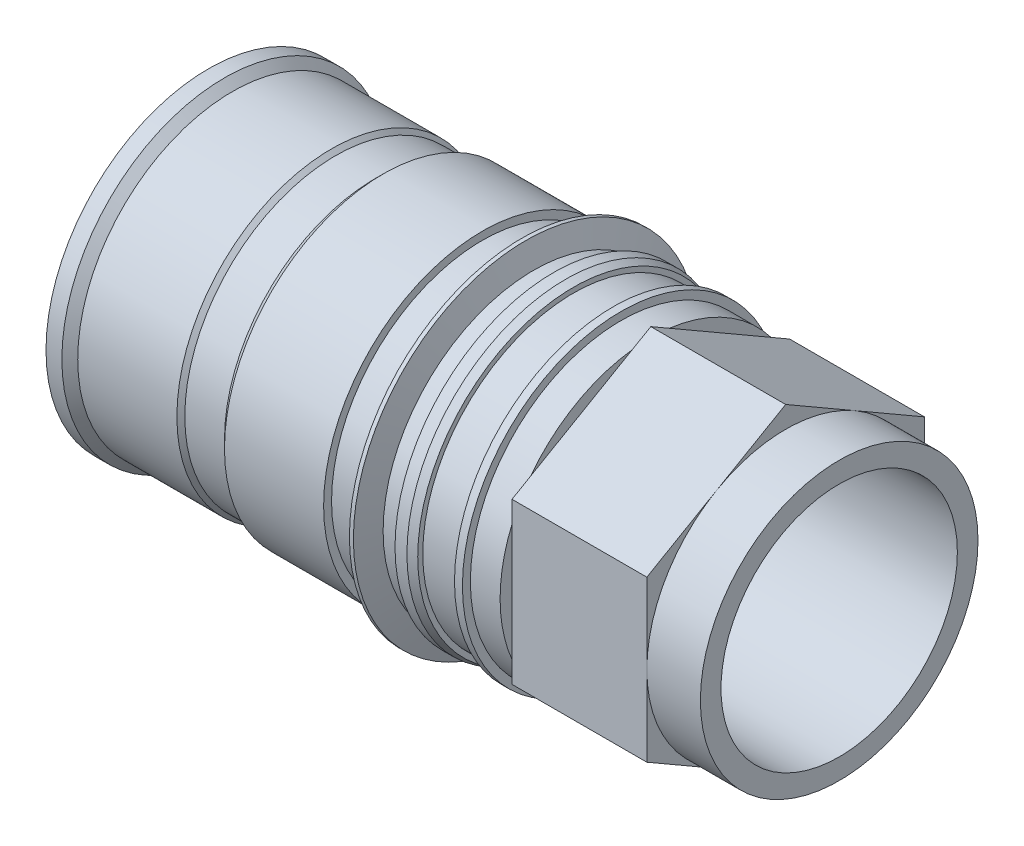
ISO-10303-21;
HEADER;
FILE_DESCRIPTION(('STEP AP214'),'2;1');
FILE_NAME('part.step','',(''),(''),'','','');
FILE_SCHEMA(('AUTOMOTIVE_DESIGN { 1 0 10303 214 1 1 1 1 }'));
ENDSEC;
DATA;
#1=APPLICATION_CONTEXT('core data for automotive mechanical design processes');
#2=APPLICATION_PROTOCOL_DEFINITION('international standard','automotive_design',2000,#1);
#3=PRODUCT_CONTEXT('',#1,'mechanical');
#4=PRODUCT('Part','Part','',(#3));
#5=PRODUCT_RELATED_PRODUCT_CATEGORY('part','',(#4));
#6=PRODUCT_DEFINITION_FORMATION('','',#4);
#7=PRODUCT_DEFINITION_CONTEXT('part definition',#1,'design');
#8=PRODUCT_DEFINITION('design','',#6,#7);
#9=PRODUCT_DEFINITION_SHAPE('','',#8);
#10=(LENGTH_UNIT() NAMED_UNIT(*) SI_UNIT(.MILLI.,.METRE.));
#11=(NAMED_UNIT(*) PLANE_ANGLE_UNIT() SI_UNIT($,.RADIAN.));
#12=(NAMED_UNIT(*) SI_UNIT($,.STERADIAN.) SOLID_ANGLE_UNIT());
#13=UNCERTAINTY_MEASURE_WITH_UNIT(LENGTH_MEASURE(1.E-05),#10,'distance_accuracy_value','');
#14=(GEOMETRIC_REPRESENTATION_CONTEXT(3) GLOBAL_UNCERTAINTY_ASSIGNED_CONTEXT((#13)) GLOBAL_UNIT_ASSIGNED_CONTEXT((#10,
#11,#12)) REPRESENTATION_CONTEXT('',''));
#15=CARTESIAN_POINT('',(0.,0.,0.));
#16=DIRECTION('',(0.,0.,1.));
#17=DIRECTION('',(1.,0.,0.));
#18=AXIS2_PLACEMENT_3D('',#15,#16,#17);
#19=CARTESIAN_POINT('',(145.5,0.,0.));
#20=DIRECTION('',(1.,0.,0.));
#21=DIRECTION('',(0.,0.,-1.));
#22=AXIS2_PLACEMENT_3D('',#19,#20,#21);
#23=PLANE('',#22);
#24=CARTESIAN_POINT('',(145.5,0.,0.));
#25=DIRECTION('',(1.,0.,0.));
#26=DIRECTION('',(0.,0.,-1.));
#27=AXIS2_PLACEMENT_3D('',#24,#25,#26);
#28=CIRCLE('',#27,35.);
#29=CARTESIAN_POINT('',(145.5,0.,-35.));
#30=VERTEX_POINT('',#29);
#31=CARTESIAN_POINT('',(145.5,30.3108891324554,-17.5));
#32=VERTEX_POINT('',#31);
#33=EDGE_CURVE('E44',#30,#32,#28,.T.);
#34=ORIENTED_EDGE('',*,*,#33,.F.);
#35=DIRECTION('',(0.,1.,0.));
#36=VECTOR('',#35,1.);
#37=CARTESIAN_POINT('',(145.5,-20.2072594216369,-35.));
#38=LINE('',#37,#36);
#39=CARTESIAN_POINT('',(145.5,20.2072594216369,-35.));
#40=VERTEX_POINT('',#39);
#41=EDGE_CURVE('E150',#30,#40,#38,.T.);
#42=ORIENTED_EDGE('',*,*,#41,.T.);
#43=DIRECTION('',(0.,0.5,0.866025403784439));
#44=VECTOR('',#43,1.);
#45=CARTESIAN_POINT('',(145.5,20.2072594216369,-35.));
#46=LINE('',#45,#44);
#47=EDGE_CURVE('E162',#40,#32,#46,.T.);
#48=ORIENTED_EDGE('',*,*,#47,.T.);
#49=EDGE_LOOP('',(#34,#42,#48));
#50=FACE_BOUND('',#49,.T.);
#51=ADVANCED_FACE('F33',(#50),#23,.T.);
#52=CARTESIAN_POINT('',(145.5,30.3108891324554,17.5));
#53=VERTEX_POINT('',#52);
#54=EDGE_CURVE('E11',#32,#53,#28,.T.);
#55=ORIENTED_EDGE('',*,*,#54,.F.);
#56=CARTESIAN_POINT('',(145.5,40.4145188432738,0.));
#57=VERTEX_POINT('',#56);
#58=EDGE_CURVE('E180',#32,#57,#46,.T.);
#59=ORIENTED_EDGE('',*,*,#58,.T.);
#60=DIRECTION('',(0.,-0.5,0.866025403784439));
#61=VECTOR('',#60,1.);
#62=CARTESIAN_POINT('',(145.5,40.4145188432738,0.));
#63=LINE('',#62,#61);
#64=EDGE_CURVE('E181',#57,#53,#63,.T.);
#65=ORIENTED_EDGE('',*,*,#64,.T.);
#66=EDGE_LOOP('',(#55,#59,#65));
#67=FACE_BOUND('',#66,.T.);
#68=ADVANCED_FACE('F371',(#67),#23,.T.);
#69=CARTESIAN_POINT('',(145.5,0.,35.));
#70=VERTEX_POINT('',#69);
#71=EDGE_CURVE('E42',#53,#70,#28,.T.);
#72=ORIENTED_EDGE('',*,*,#71,.F.);
#73=CARTESIAN_POINT('',(145.5,20.2072594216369,35.));
#74=VERTEX_POINT('',#73);
#75=EDGE_CURVE('E179',#53,#74,#63,.T.);
#76=ORIENTED_EDGE('',*,*,#75,.T.);
#77=DIRECTION('',(0.,-1.,0.));
#78=VECTOR('',#77,1.);
#79=CARTESIAN_POINT('',(145.5,20.2072594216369,35.));
#80=LINE('',#79,#78);
#81=EDGE_CURVE('E185',#74,#70,#80,.T.);
#82=ORIENTED_EDGE('',*,*,#81,.T.);
#83=EDGE_LOOP('',(#72,#76,#82));
#84=FACE_BOUND('',#83,.T.);
#85=ADVANCED_FACE('F376',(#84),#23,.T.);
#86=CARTESIAN_POINT('',(145.5,-30.3108891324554,17.5));
#87=VERTEX_POINT('',#86);
#88=EDGE_CURVE('E169',#70,#87,#28,.T.);
#89=ORIENTED_EDGE('',*,*,#88,.F.);
#90=CARTESIAN_POINT('',(145.5,-20.2072594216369,35.));
#91=VERTEX_POINT('',#90);
#92=EDGE_CURVE('E184',#70,#91,#80,.T.);
#93=ORIENTED_EDGE('',*,*,#92,.T.);
#94=DIRECTION('',(0.,-0.5,-0.866025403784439));
#95=VECTOR('',#94,1.);
#96=CARTESIAN_POINT('',(145.5,-20.2072594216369,35.));
#97=LINE('',#96,#95);
#98=EDGE_CURVE('E189',#91,#87,#97,.T.);
#99=ORIENTED_EDGE('',*,*,#98,.T.);
#100=EDGE_LOOP('',(#89,#93,#99));
#101=FACE_BOUND('',#100,.T.);
#102=ADVANCED_FACE('F390',(#101),#23,.T.);
#103=CARTESIAN_POINT('',(145.5,-30.3108891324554,-17.5));
#104=VERTEX_POINT('',#103);
#105=EDGE_CURVE('E59',#87,#104,#28,.T.);
#106=ORIENTED_EDGE('',*,*,#105,.F.);
#107=CARTESIAN_POINT('',(145.5,-40.4145188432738,0.));
#108=VERTEX_POINT('',#107);
#109=EDGE_CURVE('E188',#87,#108,#97,.T.);
#110=ORIENTED_EDGE('',*,*,#109,.T.);
#111=DIRECTION('',(0.,0.5,-0.866025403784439));
#112=VECTOR('',#111,1.);
#113=CARTESIAN_POINT('',(145.5,-40.4145188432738,0.));
#114=LINE('',#113,#112);
#115=EDGE_CURVE('E160',#108,#104,#114,.T.);
#116=ORIENTED_EDGE('',*,*,#115,.T.);
#117=EDGE_LOOP('',(#106,#110,#116));
#118=FACE_BOUND('',#117,.T.);
#119=ADVANCED_FACE('F381',(#118),#23,.T.);
#120=CARTESIAN_POINT('',(111.5,38.,0.));
#121=DIRECTION('',(-1.,0.,0.));
#122=DIRECTION('',(0.,0.,1.));
#123=AXIS2_PLACEMENT_3D('',#120,#121,#122);
#124=PLANE('',#123);
#125=DIRECTION('',(0.,0.5,0.866025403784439));
#126=VECTOR('',#125,1.);
#127=CARTESIAN_POINT('',(111.5,20.2072594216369,-35.));
#128=LINE('',#127,#126);
#129=CARTESIAN_POINT('',(111.5,22.911564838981,-30.3160056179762));
#130=VERTEX_POINT('',#129);
#131=CARTESIAN_POINT('',(111.5,37.7102134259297,-4.68399438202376));
#132=VERTEX_POINT('',#131);
#133=EDGE_CURVE('E168',#130,#132,#128,.T.);
#134=ORIENTED_EDGE('',*,*,#133,.F.);
#135=CARTESIAN_POINT('',(111.5,0.,0.));
#136=DIRECTION('',(-1.,0.,0.));
#137=DIRECTION('',(0.,0.,1.));
#138=AXIS2_PLACEMENT_3D('',#135,#136,#137);
#139=CIRCLE('',#138,38.);
#140=EDGE_CURVE('E328',#132,#130,#139,.T.);
#141=ORIENTED_EDGE('',*,*,#140,.F.);
#142=EDGE_LOOP('',(#134,#141));
#143=FACE_BOUND('',#142,.T.);
#144=ADVANCED_FACE('F365',(#143),#124,.F.);
#145=DIRECTION('',(0.,1.,0.));
#146=VECTOR('',#145,1.);
#147=CARTESIAN_POINT('',(111.5,-20.2072594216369,-35.));
#148=LINE('',#147,#146);
#149=CARTESIAN_POINT('',(111.5,-14.7986485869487,-35.));
#150=VERTEX_POINT('',#149);
#151=CARTESIAN_POINT('',(111.5,14.7986485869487,-35.));
#152=VERTEX_POINT('',#151);
#153=EDGE_CURVE('E171',#150,#152,#148,.T.);
#154=ORIENTED_EDGE('',*,*,#153,.F.);
#155=EDGE_CURVE('E334',#152,#150,#139,.T.);
#156=ORIENTED_EDGE('',*,*,#155,.F.);
#157=EDGE_LOOP('',(#154,#156));
#158=FACE_BOUND('',#157,.T.);
#159=ADVANCED_FACE('F395',(#158),#124,.F.);
#160=DIRECTION('',(0.,0.5,-0.866025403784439));
#161=VECTOR('',#160,1.);
#162=CARTESIAN_POINT('',(111.5,-40.4145188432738,0.));
#163=LINE('',#162,#161);
#164=CARTESIAN_POINT('',(111.5,-37.7102134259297,-4.68399438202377));
#165=VERTEX_POINT('',#164);
#166=CARTESIAN_POINT('',(111.5,-22.911564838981,-30.3160056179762));
#167=VERTEX_POINT('',#166);
#168=EDGE_CURVE('E214',#165,#167,#163,.T.);
#169=ORIENTED_EDGE('',*,*,#168,.F.);
#170=EDGE_CURVE('E340',#167,#165,#139,.T.);
#171=ORIENTED_EDGE('',*,*,#170,.F.);
#172=EDGE_LOOP('',(#169,#171));
#173=FACE_BOUND('',#172,.T.);
#174=ADVANCED_FACE('F366',(#173),#124,.F.);
#175=DIRECTION('',(0.,-0.5,-0.866025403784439));
#176=VECTOR('',#175,1.);
#177=CARTESIAN_POINT('',(111.5,-20.2072594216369,35.));
#178=LINE('',#177,#176);
#179=CARTESIAN_POINT('',(111.5,-22.911564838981,30.3160056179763));
#180=VERTEX_POINT('',#179);
#181=CARTESIAN_POINT('',(111.5,-37.7102134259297,4.68399438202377));
#182=VERTEX_POINT('',#181);
#183=EDGE_CURVE('E209',#180,#182,#178,.T.);
#184=ORIENTED_EDGE('',*,*,#183,.F.);
#185=EDGE_CURVE('E346',#182,#180,#139,.T.);
#186=ORIENTED_EDGE('',*,*,#185,.F.);
#187=EDGE_LOOP('',(#184,#186));
#188=FACE_BOUND('',#187,.T.);
#189=ADVANCED_FACE('F359',(#188),#124,.F.);
#190=DIRECTION('',(0.,-1.,0.));
#191=VECTOR('',#190,1.);
#192=CARTESIAN_POINT('',(111.5,20.2072594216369,35.));
#193=LINE('',#192,#191);
#194=CARTESIAN_POINT('',(111.5,14.7986485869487,35.));
#195=VERTEX_POINT('',#194);
#196=CARTESIAN_POINT('',(111.5,-14.7986485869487,35.));
#197=VERTEX_POINT('',#196);
#198=EDGE_CURVE('E204',#195,#197,#193,.T.);
#199=ORIENTED_EDGE('',*,*,#198,.F.);
#200=EDGE_CURVE('E232',#197,#195,#139,.T.);
#201=ORIENTED_EDGE('',*,*,#200,.F.);
#202=EDGE_LOOP('',(#199,#201));
#203=FACE_BOUND('',#202,.T.);
#204=ADVANCED_FACE('F357',(#203),#124,.F.);
#205=DIRECTION('',(0.,-0.5,0.866025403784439));
#206=VECTOR('',#205,1.);
#207=CARTESIAN_POINT('',(111.5,40.4145188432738,0.));
#208=LINE('',#207,#206);
#209=CARTESIAN_POINT('',(111.5,37.7102134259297,4.68399438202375));
#210=VERTEX_POINT('',#209);
#211=CARTESIAN_POINT('',(111.5,22.911564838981,30.3160056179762));
#212=VERTEX_POINT('',#211);
#213=EDGE_CURVE('E199',#210,#212,#208,.T.);
#214=ORIENTED_EDGE('',*,*,#213,.F.);
#215=EDGE_CURVE('E236',#212,#210,#139,.T.);
#216=ORIENTED_EDGE('',*,*,#215,.F.);
#217=EDGE_LOOP('',(#214,#216));
#218=FACE_BOUND('',#217,.T.);
#219=ADVANCED_FACE('F326',(#218),#124,.F.);
#220=CARTESIAN_POINT('',(0.,0.,0.));
#221=DIRECTION('',(1.,0.,0.));
#222=DIRECTION('',(0.,0.,-1.));
#223=AXIS2_PLACEMENT_3D('',#220,#221,#222);
#224=PLANE('',#223);
#225=CARTESIAN_POINT('',(0.,0.,0.));
#226=DIRECTION('',(1.,0.,0.));
#227=DIRECTION('',(0.,0.,-1.));
#228=AXIS2_PLACEMENT_3D('',#225,#226,#227);
#229=CIRCLE('',#228,29.8);
#230=CARTESIAN_POINT('',(0.,0.,-29.8));
#231=VERTEX_POINT('',#230);
#232=EDGE_CURVE('E165',#231,#231,#229,.T.);
#233=ORIENTED_EDGE('',*,*,#232,.T.);
#234=EDGE_LOOP('',(#233));
#235=FACE_BOUND('',#234,.T.);
#236=CARTESIAN_POINT('',(0.,0.,0.));
#237=DIRECTION('',(-1.,0.,0.));
#238=DIRECTION('',(0.,0.,1.));
#239=AXIS2_PLACEMENT_3D('',#236,#237,#238);
#240=CIRCLE('',#239,41.);
#241=CARTESIAN_POINT('',(0.,0.,41.));
#242=VERTEX_POINT('',#241);
#243=EDGE_CURVE('E37',#242,#242,#240,.T.);
#244=ORIENTED_EDGE('',*,*,#243,.T.);
#245=EDGE_LOOP('',(#244));
#246=FACE_BOUND('',#245,.T.);
#247=ADVANCED_FACE('F35',(#235,#246),#224,.F.);
#248=CARTESIAN_POINT('',(0.,0.,0.));
#249=DIRECTION('',(-1.,0.,0.));
#250=DIRECTION('',(0.,0.,1.));
#251=AXIS2_PLACEMENT_3D('',#248,#249,#250);
#252=CYLINDRICAL_SURFACE('',#251,41.);
#253=ORIENTED_EDGE('',*,*,#243,.F.);
#254=EDGE_LOOP('',(#253));
#255=FACE_BOUND('',#254,.T.);
#256=CARTESIAN_POINT('',(4.,0.,0.));
#257=DIRECTION('',(-1.,0.,0.));
#258=DIRECTION('',(0.,0.,1.));
#259=AXIS2_PLACEMENT_3D('',#256,#257,#258);
#260=CIRCLE('',#259,41.);
#261=CARTESIAN_POINT('',(4.,0.,41.));
#262=VERTEX_POINT('',#261);
#263=EDGE_CURVE('E295',#262,#262,#260,.T.);
#264=ORIENTED_EDGE('',*,*,#263,.T.);
#265=EDGE_LOOP('',(#264));
#266=FACE_BOUND('',#265,.T.);
#267=ADVANCED_FACE('F490',(#255,#266),#252,.T.);
#268=CARTESIAN_POINT('',(6.,0.,0.));
#269=DIRECTION('',(-1.,0.,0.));
#270=DIRECTION('',(0.,0.,1.));
#271=AXIS2_PLACEMENT_3D('',#268,#269,#270);
#272=CONICAL_SURFACE('',#271,39.,0.78539816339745);
#273=ORIENTED_EDGE('',*,*,#263,.F.);
#274=EDGE_LOOP('',(#273));
#275=FACE_BOUND('',#274,.T.);
#276=CARTESIAN_POINT('',(6.,0.,0.));
#277=DIRECTION('',(-1.,0.,0.));
#278=DIRECTION('',(0.,0.,1.));
#279=AXIS2_PLACEMENT_3D('',#276,#277,#278);
#280=CIRCLE('',#279,39.);
#281=CARTESIAN_POINT('',(6.,0.,39.));
#282=VERTEX_POINT('',#281);
#283=EDGE_CURVE('E293',#282,#282,#280,.T.);
#284=ORIENTED_EDGE('',*,*,#283,.T.);
#285=EDGE_LOOP('',(#284));
#286=FACE_BOUND('',#285,.T.);
#287=ADVANCED_FACE('F528',(#275,#286),#272,.T.);
#288=CARTESIAN_POINT('',(0.,0.,0.));
#289=DIRECTION('',(-1.,0.,0.));
#290=DIRECTION('',(0.,0.,1.));
#291=AXIS2_PLACEMENT_3D('',#288,#289,#290);
#292=CYLINDRICAL_SURFACE('',#291,39.);
#293=ORIENTED_EDGE('',*,*,#283,.F.);
#294=EDGE_LOOP('',(#293));
#295=FACE_BOUND('',#294,.T.);
#296=CARTESIAN_POINT('',(31.,0.,0.));
#297=DIRECTION('',(-1.,0.,0.));
#298=DIRECTION('',(0.,0.,1.));
#299=AXIS2_PLACEMENT_3D('',#296,#297,#298);
#300=CIRCLE('',#299,39.);
#301=CARTESIAN_POINT('',(31.,0.,39.));
#302=VERTEX_POINT('',#301);
#303=EDGE_CURVE('E290',#302,#302,#300,.T.);
#304=ORIENTED_EDGE('',*,*,#303,.T.);
#305=EDGE_LOOP('',(#304));
#306=FACE_BOUND('',#305,.T.);
#307=ADVANCED_FACE('F534',(#295,#306),#292,.T.);
#308=CARTESIAN_POINT('',(32.,0.,0.));
#309=DIRECTION('',(-1.,0.,0.));
#310=DIRECTION('',(0.,0.,1.));
#311=AXIS2_PLACEMENT_3D('',#308,#309,#310);
#312=CONICAL_SURFACE('',#311,38.,0.785398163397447);
#313=ORIENTED_EDGE('',*,*,#303,.F.);
#314=EDGE_LOOP('',(#313));
#315=FACE_BOUND('',#314,.T.);
#316=CARTESIAN_POINT('',(32.,0.,0.));
#317=DIRECTION('',(-1.,0.,0.));
#318=DIRECTION('',(0.,0.,1.));
#319=AXIS2_PLACEMENT_3D('',#316,#317,#318);
#320=CIRCLE('',#319,38.);
#321=CARTESIAN_POINT('',(32.,0.,38.));
#322=VERTEX_POINT('',#321);
#323=EDGE_CURVE('E287',#322,#322,#320,.T.);
#324=ORIENTED_EDGE('',*,*,#323,.T.);
#325=EDGE_LOOP('',(#324));
#326=FACE_BOUND('',#325,.T.);
#327=ADVANCED_FACE('F542',(#315,#326),#312,.T.);
#328=CARTESIAN_POINT('',(0.,0.,0.));
#329=DIRECTION('',(-1.,0.,0.));
#330=DIRECTION('',(0.,0.,1.));
#331=AXIS2_PLACEMENT_3D('',#328,#329,#330);
#332=CYLINDRICAL_SURFACE('',#331,38.);
#333=ORIENTED_EDGE('',*,*,#323,.F.);
#334=EDGE_LOOP('',(#333));
#335=FACE_BOUND('',#334,.T.);
#336=CARTESIAN_POINT('',(42.,0.,0.));
#337=DIRECTION('',(-1.,0.,0.));
#338=DIRECTION('',(0.,0.,1.));
#339=AXIS2_PLACEMENT_3D('',#336,#337,#338);
#340=CIRCLE('',#339,38.);
#341=CARTESIAN_POINT('',(42.,0.,38.));
#342=VERTEX_POINT('',#341);
#343=EDGE_CURVE('E284',#342,#342,#340,.T.);
#344=ORIENTED_EDGE('',*,*,#343,.T.);
#345=EDGE_LOOP('',(#344));
#346=FACE_BOUND('',#345,.T.);
#347=ADVANCED_FACE('F550',(#335,#346),#332,.T.);
#348=CARTESIAN_POINT('',(44.,0.,0.));
#349=DIRECTION('',(1.,0.,0.));
#350=DIRECTION('',(0.,0.,-1.));
#351=AXIS2_PLACEMENT_3D('',#348,#349,#350);
#352=CONICAL_SURFACE('',#351,40.,0.785398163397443);
#353=ORIENTED_EDGE('',*,*,#343,.F.);
#354=EDGE_LOOP('',(#353));
#355=FACE_BOUND('',#354,.T.);
#356=CARTESIAN_POINT('',(44.,0.,0.));
#357=DIRECTION('',(-1.,0.,0.));
#358=DIRECTION('',(0.,0.,1.));
#359=AXIS2_PLACEMENT_3D('',#356,#357,#358);
#360=CIRCLE('',#359,40.);
#361=CARTESIAN_POINT('',(44.,0.,40.));
#362=VERTEX_POINT('',#361);
#363=EDGE_CURVE('E281',#362,#362,#360,.T.);
#364=ORIENTED_EDGE('',*,*,#363,.T.);
#365=EDGE_LOOP('',(#364));
#366=FACE_BOUND('',#365,.T.);
#367=ADVANCED_FACE('F558',(#355,#366),#352,.T.);
#368=CARTESIAN_POINT('',(0.,0.,0.));
#369=DIRECTION('',(-1.,0.,0.));
#370=DIRECTION('',(0.,0.,1.));
#371=AXIS2_PLACEMENT_3D('',#368,#369,#370);
#372=CYLINDRICAL_SURFACE('',#371,40.);
#373=ORIENTED_EDGE('',*,*,#363,.F.);
#374=EDGE_LOOP('',(#373));
#375=FACE_BOUND('',#374,.T.);
#376=CARTESIAN_POINT('',(69.,0.,0.));
#377=DIRECTION('',(-1.,0.,0.));
#378=DIRECTION('',(0.,0.,1.));
#379=AXIS2_PLACEMENT_3D('',#376,#377,#378);
#380=CIRCLE('',#379,40.);
#381=CARTESIAN_POINT('',(69.,0.,40.));
#382=VERTEX_POINT('',#381);
#383=EDGE_CURVE('E278',#382,#382,#380,.T.);
#384=ORIENTED_EDGE('',*,*,#383,.T.);
#385=EDGE_LOOP('',(#384));
#386=FACE_BOUND('',#385,.T.);
#387=ADVANCED_FACE('F566',(#375,#386),#372,.T.);
#388=CARTESIAN_POINT('',(69.,40.,0.));
#389=DIRECTION('',(-1.,0.,0.));
#390=DIRECTION('',(0.,0.,1.));
#391=AXIS2_PLACEMENT_3D('',#388,#389,#390);
#392=PLANE('',#391);
#393=ORIENTED_EDGE('',*,*,#383,.F.);
#394=EDGE_LOOP('',(#393));
#395=FACE_BOUND('',#394,.T.);
#396=CARTESIAN_POINT('',(69.,0.,0.));
#397=DIRECTION('',(-1.,0.,0.));
#398=DIRECTION('',(0.,0.,1.));
#399=AXIS2_PLACEMENT_3D('',#396,#397,#398);
#400=CIRCLE('',#399,38.);
#401=CARTESIAN_POINT('',(69.,0.,38.));
#402=VERTEX_POINT('',#401);
#403=EDGE_CURVE('E275',#402,#402,#400,.T.);
#404=ORIENTED_EDGE('',*,*,#403,.T.);
#405=EDGE_LOOP('',(#404));
#406=FACE_BOUND('',#405,.T.);
#407=ADVANCED_FACE('F574',(#395,#406),#392,.F.);
#408=CARTESIAN_POINT('',(0.,0.,0.));
#409=DIRECTION('',(-1.,0.,0.));
#410=DIRECTION('',(0.,0.,1.));
#411=AXIS2_PLACEMENT_3D('',#408,#409,#410);
#412=CYLINDRICAL_SURFACE('',#411,38.);
#413=ORIENTED_EDGE('',*,*,#403,.F.);
#414=EDGE_LOOP('',(#413));
#415=FACE_BOUND('',#414,.T.);
#416=CARTESIAN_POINT('',(77.,0.,0.));
#417=DIRECTION('',(-1.,0.,0.));
#418=DIRECTION('',(0.,0.,1.));
#419=AXIS2_PLACEMENT_3D('',#416,#417,#418);
#420=CIRCLE('',#419,38.);
#421=CARTESIAN_POINT('',(77.,0.,38.));
#422=VERTEX_POINT('',#421);
#423=EDGE_CURVE('E272',#422,#422,#420,.T.);
#424=ORIENTED_EDGE('',*,*,#423,.T.);
#425=EDGE_LOOP('',(#424));
#426=FACE_BOUND('',#425,.T.);
#427=ADVANCED_FACE('F582',(#415,#426),#412,.T.);
#428=CARTESIAN_POINT('',(79.,0.,0.));
#429=DIRECTION('',(1.,0.,0.));
#430=DIRECTION('',(0.,0.,-1.));
#431=AXIS2_PLACEMENT_3D('',#428,#429,#430);
#432=CONICAL_SURFACE('',#431,43.4949548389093,1.22173047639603);
#433=ORIENTED_EDGE('',*,*,#423,.F.);
#434=EDGE_LOOP('',(#433));
#435=FACE_BOUND('',#434,.T.);
#436=CARTESIAN_POINT('',(79.,0.,0.));
#437=DIRECTION('',(-1.,0.,0.));
#438=DIRECTION('',(0.,0.,1.));
#439=AXIS2_PLACEMENT_3D('',#436,#437,#438);
#440=CIRCLE('',#439,43.4949548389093);
#441=CARTESIAN_POINT('',(79.,0.,43.4949548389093));
#442=VERTEX_POINT('',#441);
#443=EDGE_CURVE('E269',#442,#442,#440,.T.);
#444=ORIENTED_EDGE('',*,*,#443,.T.);
#445=EDGE_LOOP('',(#444));
#446=FACE_BOUND('',#445,.T.);
#447=ADVANCED_FACE('F590',(#435,#446),#432,.T.);
#448=CARTESIAN_POINT('',(0.,0.,0.));
#449=DIRECTION('',(-1.,0.,0.));
#450=DIRECTION('',(0.,0.,1.));
#451=AXIS2_PLACEMENT_3D('',#448,#449,#450);
#452=CYLINDRICAL_SURFACE('',#451,43.4949548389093);
#453=ORIENTED_EDGE('',*,*,#443,.F.);
#454=EDGE_LOOP('',(#453));
#455=FACE_BOUND('',#454,.T.);
#456=CARTESIAN_POINT('',(80.,0.,0.));
#457=DIRECTION('',(-1.,0.,0.));
#458=DIRECTION('',(0.,0.,1.));
#459=AXIS2_PLACEMENT_3D('',#456,#457,#458);
#460=CIRCLE('',#459,43.4949548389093);
#461=CARTESIAN_POINT('',(80.,0.,43.4949548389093));
#462=VERTEX_POINT('',#461);
#463=EDGE_CURVE('E266',#462,#462,#460,.T.);
#464=ORIENTED_EDGE('',*,*,#463,.T.);
#465=EDGE_LOOP('',(#464));
#466=FACE_BOUND('',#465,.T.);
#467=ADVANCED_FACE('F598',(#455,#466),#452,.T.);
#468=CARTESIAN_POINT('',(82.,0.,0.));
#469=DIRECTION('',(-1.,0.,0.));
#470=DIRECTION('',(0.,0.,1.));
#471=AXIS2_PLACEMENT_3D('',#468,#469,#470);
#472=CONICAL_SURFACE('',#471,38.,1.22173047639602);
#473=ORIENTED_EDGE('',*,*,#463,.F.);
#474=EDGE_LOOP('',(#473));
#475=FACE_BOUND('',#474,.T.);
#476=CARTESIAN_POINT('',(82.,0.,0.));
#477=DIRECTION('',(-1.,0.,0.));
#478=DIRECTION('',(0.,0.,1.));
#479=AXIS2_PLACEMENT_3D('',#476,#477,#478);
#480=CIRCLE('',#479,38.);
#481=CARTESIAN_POINT('',(82.,0.,38.));
#482=VERTEX_POINT('',#481);
#483=EDGE_CURVE('E263',#482,#482,#480,.T.);
#484=ORIENTED_EDGE('',*,*,#483,.T.);
#485=EDGE_LOOP('',(#484));
#486=FACE_BOUND('',#485,.T.);
#487=ADVANCED_FACE('F606',(#475,#486),#472,.T.);
#488=CARTESIAN_POINT('',(0.,0.,0.));
#489=DIRECTION('',(-1.,0.,0.));
#490=DIRECTION('',(0.,0.,1.));
#491=AXIS2_PLACEMENT_3D('',#488,#489,#490);
#492=CYLINDRICAL_SURFACE('',#491,38.);
#493=ORIENTED_EDGE('',*,*,#483,.F.);
#494=EDGE_LOOP('',(#493));
#495=FACE_BOUND('',#494,.T.);
#496=CARTESIAN_POINT('',(87.,0.,0.));
#497=DIRECTION('',(-1.,0.,0.));
#498=DIRECTION('',(0.,0.,1.));
#499=AXIS2_PLACEMENT_3D('',#496,#497,#498);
#500=CIRCLE('',#499,38.);
#501=CARTESIAN_POINT('',(87.,0.,38.));
#502=VERTEX_POINT('',#501);
#503=EDGE_CURVE('E260',#502,#502,#500,.T.);
#504=ORIENTED_EDGE('',*,*,#503,.T.);
#505=EDGE_LOOP('',(#504));
#506=FACE_BOUND('',#505,.T.);
#507=ADVANCED_FACE('F614',(#495,#506),#492,.T.);
#508=CARTESIAN_POINT('',(87.,38.,0.));
#509=DIRECTION('',(1.,0.,0.));
#510=DIRECTION('',(0.,0.,-1.));
#511=AXIS2_PLACEMENT_3D('',#508,#509,#510);
#512=PLANE('',#511);
#513=ORIENTED_EDGE('',*,*,#503,.F.);
#514=EDGE_LOOP('',(#513));
#515=FACE_BOUND('',#514,.T.);
#516=CARTESIAN_POINT('',(87.,0.,0.));
#517=DIRECTION('',(-1.,0.,0.));
#518=DIRECTION('',(0.,0.,1.));
#519=AXIS2_PLACEMENT_3D('',#516,#517,#518);
#520=CIRCLE('',#519,40.);
#521=CARTESIAN_POINT('',(87.,0.,40.));
#522=VERTEX_POINT('',#521);
#523=EDGE_CURVE('E257',#522,#522,#520,.T.);
#524=ORIENTED_EDGE('',*,*,#523,.T.);
#525=EDGE_LOOP('',(#524));
#526=FACE_BOUND('',#525,.T.);
#527=ADVANCED_FACE('F622',(#515,#526),#512,.F.);
#528=CARTESIAN_POINT('',(0.,0.,0.));
#529=DIRECTION('',(-1.,0.,0.));
#530=DIRECTION('',(0.,0.,1.));
#531=AXIS2_PLACEMENT_3D('',#528,#529,#530);
#532=CYLINDRICAL_SURFACE('',#531,40.);
#533=ORIENTED_EDGE('',*,*,#523,.F.);
#534=EDGE_LOOP('',(#533));
#535=FACE_BOUND('',#534,.T.);
#536=CARTESIAN_POINT('',(90.0000000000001,0.,0.));
#537=DIRECTION('',(-1.,0.,0.));
#538=DIRECTION('',(0.,0.,1.));
#539=AXIS2_PLACEMENT_3D('',#536,#537,#538);
#540=CIRCLE('',#539,40.);
#541=CARTESIAN_POINT('',(90.0000000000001,0.,40.));
#542=VERTEX_POINT('',#541);
#543=EDGE_CURVE('E254',#542,#542,#540,.T.);
#544=ORIENTED_EDGE('',*,*,#543,.T.);
#545=EDGE_LOOP('',(#544));
#546=FACE_BOUND('',#545,.T.);
#547=ADVANCED_FACE('F630',(#535,#546),#532,.T.);
#548=CARTESIAN_POINT('',(92.0000000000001,0.,0.));
#549=DIRECTION('',(-1.,0.,0.));
#550=DIRECTION('',(0.,0.,1.));
#551=AXIS2_PLACEMENT_3D('',#548,#549,#550);
#552=CONICAL_SURFACE('',#551,39.2720595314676,0.349065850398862);
#553=ORIENTED_EDGE('',*,*,#543,.F.);
#554=EDGE_LOOP('',(#553));
#555=FACE_BOUND('',#554,.T.);
#556=CARTESIAN_POINT('',(92.0000000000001,0.,0.));
#557=DIRECTION('',(-1.,0.,0.));
#558=DIRECTION('',(0.,0.,1.));
#559=AXIS2_PLACEMENT_3D('',#556,#557,#558);
#560=CIRCLE('',#559,39.2720595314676);
#561=CARTESIAN_POINT('',(92.0000000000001,0.,39.2720595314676));
#562=VERTEX_POINT('',#561);
#563=EDGE_CURVE('E251',#562,#562,#560,.T.);
#564=ORIENTED_EDGE('',*,*,#563,.T.);
#565=EDGE_LOOP('',(#564));
#566=FACE_BOUND('',#565,.T.);
#567=ADVANCED_FACE('F638',(#555,#566),#552,.T.);
#568=CARTESIAN_POINT('',(92.0000000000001,39.2720595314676,0.));
#569=DIRECTION('',(-1.,0.,0.));
#570=DIRECTION('',(0.,0.,1.));
#571=AXIS2_PLACEMENT_3D('',#568,#569,#570);
#572=PLANE('',#571);
#573=ORIENTED_EDGE('',*,*,#563,.F.);
#574=EDGE_LOOP('',(#573));
#575=FACE_BOUND('',#574,.T.);
#576=CARTESIAN_POINT('',(92.0000000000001,0.,0.));
#577=DIRECTION('',(-1.,0.,0.));
#578=DIRECTION('',(0.,0.,1.));
#579=AXIS2_PLACEMENT_3D('',#576,#577,#578);
#580=CIRCLE('',#579,38.);
#581=CARTESIAN_POINT('',(92.0000000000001,0.,38.));
#582=VERTEX_POINT('',#581);
#583=EDGE_CURVE('E248',#582,#582,#580,.T.);
#584=ORIENTED_EDGE('',*,*,#583,.T.);
#585=EDGE_LOOP('',(#584));
#586=FACE_BOUND('',#585,.T.);
#587=ADVANCED_FACE('F646',(#575,#586),#572,.F.);
#588=CARTESIAN_POINT('',(0.,0.,0.));
#589=DIRECTION('',(-1.,0.,0.));
#590=DIRECTION('',(0.,0.,1.));
#591=AXIS2_PLACEMENT_3D('',#588,#589,#590);
#592=CYLINDRICAL_SURFACE('',#591,38.);
#593=ORIENTED_EDGE('',*,*,#583,.F.);
#594=EDGE_LOOP('',(#593));
#595=FACE_BOUND('',#594,.T.);
#596=CARTESIAN_POINT('',(102.,0.,0.));
#597=DIRECTION('',(-1.,0.,0.));
#598=DIRECTION('',(0.,0.,1.));
#599=AXIS2_PLACEMENT_3D('',#596,#597,#598);
#600=CIRCLE('',#599,38.);
#601=CARTESIAN_POINT('',(102.,0.,38.));
#602=VERTEX_POINT('',#601);
#603=EDGE_CURVE('E245',#602,#602,#600,.T.);
#604=ORIENTED_EDGE('',*,*,#603,.T.);
#605=EDGE_LOOP('',(#604));
#606=FACE_BOUND('',#605,.T.);
#607=ADVANCED_FACE('F654',(#595,#606),#592,.T.);
#608=CARTESIAN_POINT('',(102.,38.,0.));
#609=DIRECTION('',(1.,0.,0.));
#610=DIRECTION('',(0.,0.,-1.));
#611=AXIS2_PLACEMENT_3D('',#608,#609,#610);
#612=PLANE('',#611);
#613=ORIENTED_EDGE('',*,*,#603,.F.);
#614=EDGE_LOOP('',(#613));
#615=FACE_BOUND('',#614,.T.);
#616=CARTESIAN_POINT('',(102.,0.,0.));
#617=DIRECTION('',(-1.,0.,0.));
#618=DIRECTION('',(0.,0.,1.));
#619=AXIS2_PLACEMENT_3D('',#616,#617,#618);
#620=CIRCLE('',#619,40.);
#621=CARTESIAN_POINT('',(102.,0.,40.));
#622=VERTEX_POINT('',#621);
#623=EDGE_CURVE('E242',#622,#622,#620,.T.);
#624=ORIENTED_EDGE('',*,*,#623,.T.);
#625=EDGE_LOOP('',(#624));
#626=FACE_BOUND('',#625,.T.);
#627=ADVANCED_FACE('F662',(#615,#626),#612,.F.);
#628=CARTESIAN_POINT('',(0.,0.,0.));
#629=DIRECTION('',(-1.,0.,0.));
#630=DIRECTION('',(0.,0.,1.));
#631=AXIS2_PLACEMENT_3D('',#628,#629,#630);
#632=CYLINDRICAL_SURFACE('',#631,40.);
#633=ORIENTED_EDGE('',*,*,#623,.F.);
#634=EDGE_LOOP('',(#633));
#635=FACE_BOUND('',#634,.T.);
#636=CARTESIAN_POINT('',(104.,0.,0.));
#637=DIRECTION('',(-1.,0.,0.));
#638=DIRECTION('',(0.,0.,1.));
#639=AXIS2_PLACEMENT_3D('',#636,#637,#638);
#640=CIRCLE('',#639,40.);
#641=CARTESIAN_POINT('',(104.,0.,40.));
#642=VERTEX_POINT('',#641);
#643=EDGE_CURVE('E239',#642,#642,#640,.T.);
#644=ORIENTED_EDGE('',*,*,#643,.T.);
#645=EDGE_LOOP('',(#644));
#646=FACE_BOUND('',#645,.T.);
#647=ADVANCED_FACE('F670',(#635,#646),#632,.T.);
#648=CARTESIAN_POINT('',(104.,40.,0.));
#649=DIRECTION('',(-1.,0.,0.));
#650=DIRECTION('',(0.,0.,1.));
#651=AXIS2_PLACEMENT_3D('',#648,#649,#650);
#652=PLANE('',#651);
#653=ORIENTED_EDGE('',*,*,#643,.F.);
#654=EDGE_LOOP('',(#653));
#655=FACE_BOUND('',#654,.T.);
#656=CARTESIAN_POINT('',(104.,0.,0.));
#657=DIRECTION('',(-1.,0.,0.));
#658=DIRECTION('',(0.,0.,1.));
#659=AXIS2_PLACEMENT_3D('',#656,#657,#658);
#660=CIRCLE('',#659,38.);
#661=CARTESIAN_POINT('',(104.,0.,38.));
#662=VERTEX_POINT('',#661);
#663=EDGE_CURVE('E235',#662,#662,#660,.T.);
#664=ORIENTED_EDGE('',*,*,#663,.T.);
#665=EDGE_LOOP('',(#664));
#666=FACE_BOUND('',#665,.T.);
#667=ADVANCED_FACE('F678',(#655,#666),#652,.F.);
#668=CARTESIAN_POINT('',(0.,0.,0.));
#669=DIRECTION('',(-1.,0.,0.));
#670=DIRECTION('',(0.,0.,1.));
#671=AXIS2_PLACEMENT_3D('',#668,#669,#670);
#672=CYLINDRICAL_SURFACE('',#671,38.);
#673=ORIENTED_EDGE('',*,*,#663,.F.);
#674=EDGE_LOOP('',(#673));
#675=FACE_BOUND('',#674,.T.);
#676=EDGE_CURVE('E233',#195,#212,#139,.T.);
#677=ORIENTED_EDGE('',*,*,#676,.T.);
#678=ORIENTED_EDGE('',*,*,#215,.T.);
#679=EDGE_CURVE('E327',#210,#132,#139,.T.);
#680=ORIENTED_EDGE('',*,*,#679,.T.);
#681=ORIENTED_EDGE('',*,*,#140,.T.);
#682=EDGE_CURVE('E331',#130,#152,#139,.T.);
#683=ORIENTED_EDGE('',*,*,#682,.T.);
#684=ORIENTED_EDGE('',*,*,#155,.T.);
#685=EDGE_CURVE('E337',#150,#167,#139,.T.);
#686=ORIENTED_EDGE('',*,*,#685,.T.);
#687=ORIENTED_EDGE('',*,*,#170,.T.);
#688=EDGE_CURVE('E343',#165,#182,#139,.T.);
#689=ORIENTED_EDGE('',*,*,#688,.T.);
#690=ORIENTED_EDGE('',*,*,#185,.T.);
#691=EDGE_CURVE('E349',#180,#197,#139,.T.);
#692=ORIENTED_EDGE('',*,*,#691,.T.);
#693=ORIENTED_EDGE('',*,*,#200,.T.);
#694=EDGE_LOOP('',(#677,#678,#680,#681,#683,#684,#686,#687,#689,#690,#692,#693));
#695=FACE_BOUND('',#694,.T.);
#696=ADVANCED_FACE('F321',(#675,#695),#672,.T.);
#697=CARTESIAN_POINT('',(111.5,0.,0.));
#698=DIRECTION('',(1.,0.,0.));
#699=DIRECTION('',(0.,0.,-1.));
#700=AXIS2_PLACEMENT_3D('',#697,#698,#699);
#701=PLANE('',#700);
#702=ORIENTED_EDGE('',*,*,#676,.F.);
#703=CARTESIAN_POINT('',(111.5,20.2072594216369,35.));
#704=VERTEX_POINT('',#703);
#705=EDGE_CURVE('E200',#704,#195,#193,.T.);
#706=ORIENTED_EDGE('',*,*,#705,.F.);
#707=EDGE_CURVE('E194',#212,#704,#208,.T.);
#708=ORIENTED_EDGE('',*,*,#707,.F.);
#709=EDGE_LOOP('',(#702,#706,#708));
#710=FACE_BOUND('',#709,.T.);
#711=ADVANCED_FACE('F316',(#710),#701,.F.);
#712=ORIENTED_EDGE('',*,*,#679,.F.);
#713=CARTESIAN_POINT('',(111.5,40.4145188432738,0.));
#714=VERTEX_POINT('',#713);
#715=EDGE_CURVE('E195',#714,#210,#208,.T.);
#716=ORIENTED_EDGE('',*,*,#715,.F.);
#717=EDGE_CURVE('E174',#132,#714,#128,.T.);
#718=ORIENTED_EDGE('',*,*,#717,.F.);
#719=EDGE_LOOP('',(#712,#716,#718));
#720=FACE_BOUND('',#719,.T.);
#721=ADVANCED_FACE('F411',(#720),#701,.F.);
#722=ORIENTED_EDGE('',*,*,#682,.F.);
#723=CARTESIAN_POINT('',(111.5,20.2072594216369,-35.));
#724=VERTEX_POINT('',#723);
#725=EDGE_CURVE('E173',#724,#130,#128,.T.);
#726=ORIENTED_EDGE('',*,*,#725,.F.);
#727=EDGE_CURVE('E213',#152,#724,#148,.T.);
#728=ORIENTED_EDGE('',*,*,#727,.F.);
#729=EDGE_LOOP('',(#722,#726,#728));
#730=FACE_BOUND('',#729,.T.);
#731=ADVANCED_FACE('F414',(#730),#701,.F.);
#732=ORIENTED_EDGE('',*,*,#685,.F.);
#733=CARTESIAN_POINT('',(111.5,-20.2072594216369,-35.));
#734=VERTEX_POINT('',#733);
#735=EDGE_CURVE('E215',#734,#150,#148,.T.);
#736=ORIENTED_EDGE('',*,*,#735,.F.);
#737=EDGE_CURVE('E208',#167,#734,#163,.T.);
#738=ORIENTED_EDGE('',*,*,#737,.F.);
#739=EDGE_LOOP('',(#732,#736,#738));
#740=FACE_BOUND('',#739,.T.);
#741=ADVANCED_FACE('F422',(#740),#701,.F.);
#742=ORIENTED_EDGE('',*,*,#688,.F.);
#743=CARTESIAN_POINT('',(111.5,-40.4145188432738,0.));
#744=VERTEX_POINT('',#743);
#745=EDGE_CURVE('E210',#744,#165,#163,.T.);
#746=ORIENTED_EDGE('',*,*,#745,.F.);
#747=EDGE_CURVE('E203',#182,#744,#178,.T.);
#748=ORIENTED_EDGE('',*,*,#747,.F.);
#749=EDGE_LOOP('',(#742,#746,#748));
#750=FACE_BOUND('',#749,.T.);
#751=ADVANCED_FACE('F386',(#750),#701,.F.);
#752=CARTESIAN_POINT('',(145.5,20.2072594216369,-35.));
#753=DIRECTION('',(0.,-0.866025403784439,0.5));
#754=DIRECTION('',(0.,-0.5,-0.866025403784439));
#755=AXIS2_PLACEMENT_3D('',#752,#753,#754);
#756=PLANE('',#755);
#757=ORIENTED_EDGE('',*,*,#725,.T.);
#758=ORIENTED_EDGE('',*,*,#133,.T.);
#759=ORIENTED_EDGE('',*,*,#717,.T.);
#760=DIRECTION('',(-1.,0.,0.));
#761=VECTOR('',#760,1.);
#762=CARTESIAN_POINT('',(145.5,40.4145188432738,0.));
#763=LINE('',#762,#761);
#764=EDGE_CURVE('E229',#57,#714,#763,.T.);
#765=ORIENTED_EDGE('',*,*,#764,.F.);
#766=ORIENTED_EDGE('',*,*,#58,.F.);
#767=ORIENTED_EDGE('',*,*,#47,.F.);
#768=DIRECTION('',(-1.,0.,0.));
#769=VECTOR('',#768,1.);
#770=CARTESIAN_POINT('',(145.5,20.2072594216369,-35.));
#771=LINE('',#770,#769);
#772=EDGE_CURVE('E149',#40,#724,#771,.T.);
#773=ORIENTED_EDGE('',*,*,#772,.T.);
#774=EDGE_LOOP('',(#757,#758,#759,#765,#766,#767,#773));
#775=FACE_BOUND('',#774,.T.);
#776=ADVANCED_FACE('F408',(#775),#756,.F.);
#777=CARTESIAN_POINT('',(145.5,40.4145188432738,0.));
#778=DIRECTION('',(0.,-0.866025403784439,-0.5));
#779=DIRECTION('',(0.,0.5,-0.866025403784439));
#780=AXIS2_PLACEMENT_3D('',#777,#778,#779);
#781=PLANE('',#780);
#782=ORIENTED_EDGE('',*,*,#715,.T.);
#783=ORIENTED_EDGE('',*,*,#213,.T.);
#784=ORIENTED_EDGE('',*,*,#707,.T.);
#785=DIRECTION('',(-1.,0.,0.));
#786=VECTOR('',#785,1.);
#787=CARTESIAN_POINT('',(145.5,20.2072594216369,35.));
#788=LINE('',#787,#786);
#789=EDGE_CURVE('E226',#74,#704,#788,.T.);
#790=ORIENTED_EDGE('',*,*,#789,.F.);
#791=ORIENTED_EDGE('',*,*,#75,.F.);
#792=ORIENTED_EDGE('',*,*,#64,.F.);
#793=ORIENTED_EDGE('',*,*,#764,.T.);
#794=EDGE_LOOP('',(#782,#783,#784,#790,#791,#792,#793));
#795=FACE_BOUND('',#794,.T.);
#796=ADVANCED_FACE('F307',(#795),#781,.F.);
#797=CARTESIAN_POINT('',(145.5,20.2072594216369,35.));
#798=DIRECTION('',(0.,0.,-1.));
#799=DIRECTION('',(-1.,0.,0.));
#800=AXIS2_PLACEMENT_3D('',#797,#798,#799);
#801=PLANE('',#800);
#802=ORIENTED_EDGE('',*,*,#705,.T.);
#803=ORIENTED_EDGE('',*,*,#198,.T.);
#804=CARTESIAN_POINT('',(111.5,-20.2072594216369,35.));
#805=VERTEX_POINT('',#804);
#806=EDGE_CURVE('E198',#197,#805,#193,.T.);
#807=ORIENTED_EDGE('',*,*,#806,.T.);
#808=DIRECTION('',(-1.,0.,0.));
#809=VECTOR('',#808,1.);
#810=CARTESIAN_POINT('',(145.5,-20.2072594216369,35.));
#811=LINE('',#810,#809);
#812=EDGE_CURVE('E223',#91,#805,#811,.T.);
#813=ORIENTED_EDGE('',*,*,#812,.F.);
#814=ORIENTED_EDGE('',*,*,#92,.F.);
#815=ORIENTED_EDGE('',*,*,#81,.F.);
#816=ORIENTED_EDGE('',*,*,#789,.T.);
#817=EDGE_LOOP('',(#802,#803,#807,#813,#814,#815,#816));
#818=FACE_BOUND('',#817,.T.);
#819=ADVANCED_FACE('F314',(#818),#801,.F.);
#820=CARTESIAN_POINT('',(145.5,-20.2072594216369,35.));
#821=DIRECTION('',(0.,0.866025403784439,-0.5));
#822=DIRECTION('',(0.,0.5,0.866025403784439));
#823=AXIS2_PLACEMENT_3D('',#820,#821,#822);
#824=PLANE('',#823);
#825=EDGE_CURVE('E205',#805,#180,#178,.T.);
#826=ORIENTED_EDGE('',*,*,#825,.T.);
#827=ORIENTED_EDGE('',*,*,#183,.T.);
#828=ORIENTED_EDGE('',*,*,#747,.T.);
#829=DIRECTION('',(-1.,0.,0.));
#830=VECTOR('',#829,1.);
#831=CARTESIAN_POINT('',(145.5,-40.4145188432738,0.));
#832=LINE('',#831,#830);
#833=EDGE_CURVE('E220',#108,#744,#832,.T.);
#834=ORIENTED_EDGE('',*,*,#833,.F.);
#835=ORIENTED_EDGE('',*,*,#109,.F.);
#836=ORIENTED_EDGE('',*,*,#98,.F.);
#837=ORIENTED_EDGE('',*,*,#812,.T.);
#838=EDGE_LOOP('',(#826,#827,#828,#834,#835,#836,#837));
#839=FACE_BOUND('',#838,.T.);
#840=ADVANCED_FACE('F432',(#839),#824,.F.);
#841=CARTESIAN_POINT('',(145.5,-40.4145188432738,0.));
#842=DIRECTION('',(0.,0.866025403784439,0.5));
#843=DIRECTION('',(0.,-0.5,0.866025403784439));
#844=AXIS2_PLACEMENT_3D('',#841,#842,#843);
#845=PLANE('',#844);
#846=ORIENTED_EDGE('',*,*,#745,.T.);
#847=ORIENTED_EDGE('',*,*,#168,.T.);
#848=ORIENTED_EDGE('',*,*,#737,.T.);
#849=DIRECTION('',(-1.,0.,0.));
#850=VECTOR('',#849,1.);
#851=CARTESIAN_POINT('',(145.5,-20.2072594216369,-35.));
#852=LINE('',#851,#850);
#853=CARTESIAN_POINT('',(145.5,-20.2072594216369,-35.));
#854=VERTEX_POINT('',#853);
#855=EDGE_CURVE('E218',#854,#734,#852,.T.);
#856=ORIENTED_EDGE('',*,*,#855,.F.);
#857=EDGE_CURVE('E145',#104,#854,#114,.T.);
#858=ORIENTED_EDGE('',*,*,#857,.F.);
#859=ORIENTED_EDGE('',*,*,#115,.F.);
#860=ORIENTED_EDGE('',*,*,#833,.T.);
#861=EDGE_LOOP('',(#846,#847,#848,#856,#858,#859,#860));
#862=FACE_BOUND('',#861,.T.);
#863=ADVANCED_FACE('F387',(#862),#845,.F.);
#864=CARTESIAN_POINT('',(145.5,-20.2072594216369,-35.));
#865=DIRECTION('',(0.,0.,1.));
#866=DIRECTION('',(1.,0.,0.));
#867=AXIS2_PLACEMENT_3D('',#864,#865,#866);
#868=PLANE('',#867);
#869=ORIENTED_EDGE('',*,*,#735,.T.);
#870=ORIENTED_EDGE('',*,*,#153,.T.);
#871=ORIENTED_EDGE('',*,*,#727,.T.);
#872=ORIENTED_EDGE('',*,*,#772,.F.);
#873=ORIENTED_EDGE('',*,*,#41,.F.);
#874=EDGE_CURVE('E142',#854,#30,#38,.T.);
#875=ORIENTED_EDGE('',*,*,#874,.F.);
#876=ORIENTED_EDGE('',*,*,#855,.T.);
#877=EDGE_LOOP('',(#869,#870,#871,#872,#873,#875,#876));
#878=FACE_BOUND('',#877,.T.);
#879=ADVANCED_FACE('F155',(#878),#868,.F.);
#880=EDGE_CURVE('E51',#104,#30,#28,.T.);
#881=ORIENTED_EDGE('',*,*,#880,.F.);
#882=ORIENTED_EDGE('',*,*,#857,.T.);
#883=ORIENTED_EDGE('',*,*,#874,.T.);
#884=EDGE_LOOP('',(#881,#882,#883));
#885=FACE_BOUND('',#884,.T.);
#886=ADVANCED_FACE('F144',(#885),#23,.T.);
#887=ORIENTED_EDGE('',*,*,#691,.F.);
#888=ORIENTED_EDGE('',*,*,#825,.F.);
#889=ORIENTED_EDGE('',*,*,#806,.F.);
#890=EDGE_LOOP('',(#887,#888,#889));
#891=FACE_BOUND('',#890,.T.);
#892=ADVANCED_FACE('F354',(#891),#701,.F.);
#893=CARTESIAN_POINT('',(159.,0.,0.));
#894=DIRECTION('',(-1.,0.,0.));
#895=DIRECTION('',(0.,0.,1.));
#896=AXIS2_PLACEMENT_3D('',#893,#894,#895);
#897=CYLINDRICAL_SURFACE('',#896,35.);
#898=CARTESIAN_POINT('',(159.,0.,0.));
#899=DIRECTION('',(1.,0.,0.));
#900=DIRECTION('',(0.,0.,-1.));
#901=AXIS2_PLACEMENT_3D('',#898,#899,#900);
#902=CIRCLE('',#901,35.);
#903=CARTESIAN_POINT('',(159.,0.,-35.));
#904=VERTEX_POINT('',#903);
#905=EDGE_CURVE('E164',#904,#904,#902,.T.);
#906=ORIENTED_EDGE('',*,*,#905,.F.);
#907=EDGE_LOOP('',(#906));
#908=FACE_BOUND('',#907,.T.);
#909=ORIENTED_EDGE('',*,*,#33,.T.);
#910=ORIENTED_EDGE('',*,*,#54,.T.);
#911=ORIENTED_EDGE('',*,*,#71,.T.);
#912=ORIENTED_EDGE('',*,*,#88,.T.);
#913=ORIENTED_EDGE('',*,*,#105,.T.);
#914=ORIENTED_EDGE('',*,*,#880,.T.);
#915=EDGE_LOOP('',(#909,#910,#911,#912,#913,#914));
#916=FACE_BOUND('',#915,.T.);
#917=ADVANCED_FACE('F166',(#908,#916),#897,.T.);
#918=CARTESIAN_POINT('',(159.,0.,0.));
#919=DIRECTION('',(1.,0.,0.));
#920=DIRECTION('',(0.,0.,-1.));
#921=AXIS2_PLACEMENT_3D('',#918,#919,#920);
#922=PLANE('',#921);
#923=CARTESIAN_POINT('',(159.,0.,0.));
#924=DIRECTION('',(1.,0.,0.));
#925=DIRECTION('',(0.,0.,-1.));
#926=AXIS2_PLACEMENT_3D('',#923,#924,#925);
#927=CIRCLE('',#926,29.8);
#928=CARTESIAN_POINT('',(159.,0.,-29.8));
#929=VERTEX_POINT('',#928);
#930=EDGE_CURVE('E518',#929,#929,#927,.T.);
#931=ORIENTED_EDGE('',*,*,#930,.F.);
#932=EDGE_LOOP('',(#931));
#933=FACE_BOUND('',#932,.T.);
#934=ORIENTED_EDGE('',*,*,#905,.T.);
#935=EDGE_LOOP('',(#934));
#936=FACE_BOUND('',#935,.T.);
#937=ADVANCED_FACE('F478',(#933,#936),#922,.T.);
#938=CARTESIAN_POINT('',(0.,0.,0.));
#939=DIRECTION('',(1.,0.,0.));
#940=DIRECTION('',(0.,0.,-1.));
#941=AXIS2_PLACEMENT_3D('',#938,#939,#940);
#942=CYLINDRICAL_SURFACE('',#941,29.8);
#943=ORIENTED_EDGE('',*,*,#232,.F.);
#944=EDGE_LOOP('',(#943));
#945=FACE_BOUND('',#944,.T.);
#946=ORIENTED_EDGE('',*,*,#930,.T.);
#947=EDGE_LOOP('',(#946));
#948=FACE_BOUND('',#947,.T.);
#949=ADVANCED_FACE('F499',(#945,#948),#942,.F.);
#950=CLOSED_SHELL('',(#51,#68,#85,#102,#119,#144,#159,#174,#189,#204,#219,#247,#267,#287,#307,
#327,#347,#367,#387,#407,#427,#447,#467,#487,#507,#527,#547,#567,#587,#607,#627,#647,#667,#696,
#711,#721,#731,#741,#751,#776,#796,#819,#840,#863,#879,#886,#892,#917,#937,#949));
#951=MANIFOLD_SOLID_BREP('B2',#950);
#952=ADVANCED_BREP_SHAPE_REPRESENTATION('',(#18,#951),#14);
#953=SHAPE_DEFINITION_REPRESENTATION(#9,#952);
ENDSEC;
END-ISO-10303-21;
